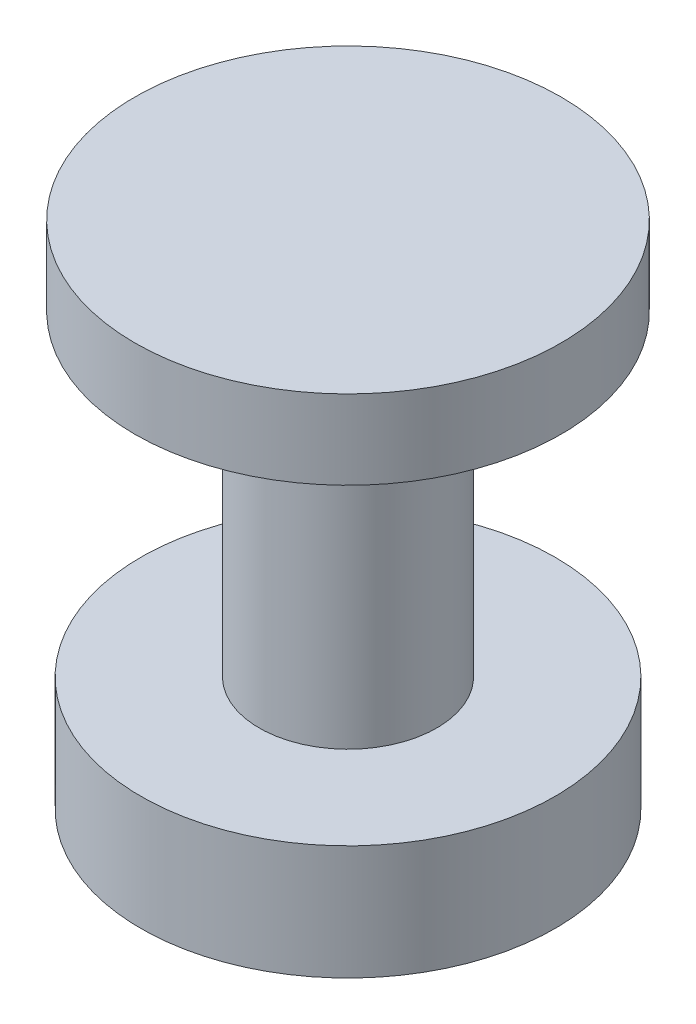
ISO-10303-21;
HEADER;
FILE_DESCRIPTION(('STEP AP214'),'2;1');
FILE_NAME('part.step','',(''),(''),'','','');
FILE_SCHEMA(('AUTOMOTIVE_DESIGN { 1 0 10303 214 1 1 1 1 }'));
ENDSEC;
DATA;
#1=APPLICATION_CONTEXT('core data for automotive mechanical design processes');
#2=APPLICATION_PROTOCOL_DEFINITION('international standard','automotive_design',2000,#1);
#3=PRODUCT_CONTEXT('',#1,'mechanical');
#4=PRODUCT('Part','Part','',(#3));
#5=PRODUCT_RELATED_PRODUCT_CATEGORY('part','',(#4));
#6=PRODUCT_DEFINITION_FORMATION('','',#4);
#7=PRODUCT_DEFINITION_CONTEXT('part definition',#1,'design');
#8=PRODUCT_DEFINITION('design','',#6,#7);
#9=PRODUCT_DEFINITION_SHAPE('','',#8);
#10=(LENGTH_UNIT() NAMED_UNIT(*) SI_UNIT(.MILLI.,.METRE.));
#11=(NAMED_UNIT(*) PLANE_ANGLE_UNIT() SI_UNIT($,.RADIAN.));
#12=(NAMED_UNIT(*) SI_UNIT($,.STERADIAN.) SOLID_ANGLE_UNIT());
#13=UNCERTAINTY_MEASURE_WITH_UNIT(LENGTH_MEASURE(1.E-05),#10,'distance_accuracy_value','');
#14=(GEOMETRIC_REPRESENTATION_CONTEXT(3) GLOBAL_UNCERTAINTY_ASSIGNED_CONTEXT((#13)) GLOBAL_UNIT_ASSIGNED_CONTEXT((#10,
#11,#12)) REPRESENTATION_CONTEXT('',''));
#15=CARTESIAN_POINT('',(0.,0.,0.));
#16=DIRECTION('',(0.,0.,1.));
#17=DIRECTION('',(1.,0.,0.));
#18=AXIS2_PLACEMENT_3D('',#15,#16,#17);
#19=CARTESIAN_POINT('',(0.,32.265731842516,0.));
#20=DIRECTION('',(0.,1.,0.));
#21=DIRECTION('',(0.,0.,1.));
#22=AXIS2_PLACEMENT_3D('',#19,#20,#21);
#23=PLANE('',#22);
#24=CARTESIAN_POINT('',(0.,32.265731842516,0.));
#25=DIRECTION('',(0.,-1.,0.));
#26=DIRECTION('',(0.,0.,-1.));
#27=AXIS2_PLACEMENT_3D('',#24,#25,#26);
#28=CIRCLE('',#27,13.4791443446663);
#29=CARTESIAN_POINT('',(0.,32.265731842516,-13.4791443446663));
#30=VERTEX_POINT('',#29);
#31=EDGE_CURVE('E10',#30,#30,#28,.T.);
#32=ORIENTED_EDGE('',*,*,#31,.F.);
#33=EDGE_LOOP('',(#32));
#34=FACE_BOUND('',#33,.T.);
#35=ADVANCED_FACE('F30',(#34),#23,.T.);
#36=CARTESIAN_POINT('',(0.,0.,0.));
#37=DIRECTION('',(0.,-1.,0.));
#38=DIRECTION('',(0.,0.,-1.));
#39=AXIS2_PLACEMENT_3D('',#36,#37,#38);
#40=CYLINDRICAL_SURFACE('',#39,13.4791443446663);
#41=ORIENTED_EDGE('',*,*,#31,.T.);
#42=EDGE_LOOP('',(#41));
#43=FACE_BOUND('',#42,.T.);
#44=CARTESIAN_POINT('',(0.,27.2609008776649,0.));
#45=DIRECTION('',(0.,-1.,0.));
#46=DIRECTION('',(0.,0.,-1.));
#47=AXIS2_PLACEMENT_3D('',#44,#45,#46);
#48=CIRCLE('',#47,13.4791443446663);
#49=CARTESIAN_POINT('',(0.,27.2609008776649,-13.4791443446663));
#50=VERTEX_POINT('',#49);
#51=EDGE_CURVE('E36',#50,#50,#48,.T.);
#52=ORIENTED_EDGE('',*,*,#51,.F.);
#53=EDGE_LOOP('',(#52));
#54=FACE_BOUND('',#53,.T.);
#55=ADVANCED_FACE('F72',(#43,#54),#40,.T.);
#56=CARTESIAN_POINT('',(13.4791443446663,27.2609008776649,0.));
#57=DIRECTION('',(0.,-1.,0.));
#58=DIRECTION('',(0.,0.,-1.));
#59=AXIS2_PLACEMENT_3D('',#56,#57,#58);
#60=PLANE('',#59);
#61=ORIENTED_EDGE('',*,*,#51,.T.);
#62=EDGE_LOOP('',(#61));
#63=FACE_BOUND('',#62,.T.);
#64=CARTESIAN_POINT('',(0.,27.2609008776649,0.));
#65=DIRECTION('',(0.,-1.,0.));
#66=DIRECTION('',(0.,0.,-1.));
#67=AXIS2_PLACEMENT_3D('',#64,#65,#66);
#68=CIRCLE('',#67,5.61771872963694);
#69=CARTESIAN_POINT('',(0.,27.2609008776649,-5.61771872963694));
#70=VERTEX_POINT('',#69);
#71=EDGE_CURVE('E40',#70,#70,#68,.T.);
#72=ORIENTED_EDGE('',*,*,#71,.F.);
#73=EDGE_LOOP('',(#72));
#74=FACE_BOUND('',#73,.T.);
#75=ADVANCED_FACE('F77',(#63,#74),#60,.T.);
#76=CARTESIAN_POINT('',(0.,0.,0.));
#77=DIRECTION('',(0.,-1.,0.));
#78=DIRECTION('',(0.,0.,-1.));
#79=AXIS2_PLACEMENT_3D('',#76,#77,#78);
#80=CYLINDRICAL_SURFACE('',#79,5.61771872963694);
#81=ORIENTED_EDGE('',*,*,#71,.T.);
#82=EDGE_LOOP('',(#81));
#83=FACE_BOUND('',#82,.T.);
#84=CARTESIAN_POINT('',(0.,7.24157701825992,0.));
#85=DIRECTION('',(0.,-1.,0.));
#86=DIRECTION('',(0.,0.,-1.));
#87=AXIS2_PLACEMENT_3D('',#84,#85,#86);
#88=CIRCLE('',#87,5.61771872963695);
#89=CARTESIAN_POINT('',(0.,7.24157701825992,-5.61771872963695));
#90=VERTEX_POINT('',#89);
#91=EDGE_CURVE('E44',#90,#90,#88,.T.);
#92=ORIENTED_EDGE('',*,*,#91,.F.);
#93=EDGE_LOOP('',(#92));
#94=FACE_BOUND('',#93,.T.);
#95=ADVANCED_FACE('F68',(#83,#94),#80,.T.);
#96=CARTESIAN_POINT('',(5.61771872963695,7.24157701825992,0.));
#97=DIRECTION('',(0.,1.,0.));
#98=DIRECTION('',(0.,0.,1.));
#99=AXIS2_PLACEMENT_3D('',#96,#97,#98);
#100=PLANE('',#99);
#101=ORIENTED_EDGE('',*,*,#91,.T.);
#102=EDGE_LOOP('',(#101));
#103=FACE_BOUND('',#102,.T.);
#104=CARTESIAN_POINT('',(0.,7.24157701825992,0.));
#105=DIRECTION('',(0.,-1.,0.));
#106=DIRECTION('',(0.,0.,-1.));
#107=AXIS2_PLACEMENT_3D('',#104,#105,#106);
#108=CIRCLE('',#107,13.1012244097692);
#109=CARTESIAN_POINT('',(0.,7.24157701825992,-13.1012244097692));
#110=VERTEX_POINT('',#109);
#111=EDGE_CURVE('E49',#110,#110,#108,.T.);
#112=ORIENTED_EDGE('',*,*,#111,.F.);
#113=EDGE_LOOP('',(#112));
#114=FACE_BOUND('',#113,.T.);
#115=ADVANCED_FACE('F60',(#103,#114),#100,.T.);
#116=CARTESIAN_POINT('',(0.,0.,0.));
#117=DIRECTION('',(0.,-1.,0.));
#118=DIRECTION('',(0.,0.,-1.));
#119=AXIS2_PLACEMENT_3D('',#116,#117,#118);
#120=CYLINDRICAL_SURFACE('',#119,13.1012244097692);
#121=ORIENTED_EDGE('',*,*,#111,.T.);
#122=EDGE_LOOP('',(#121));
#123=FACE_BOUND('',#122,.T.);
#124=CARTESIAN_POINT('',(0.,0.,0.));
#125=DIRECTION('',(0.,-1.,0.));
#126=DIRECTION('',(0.,0.,-1.));
#127=AXIS2_PLACEMENT_3D('',#124,#125,#126);
#128=CIRCLE('',#127,13.1012244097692);
#129=CARTESIAN_POINT('',(0.,0.,-13.1012244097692));
#130=VERTEX_POINT('',#129);
#131=EDGE_CURVE('E52',#130,#130,#128,.T.);
#132=ORIENTED_EDGE('',*,*,#131,.F.);
#133=EDGE_LOOP('',(#132));
#134=FACE_BOUND('',#133,.T.);
#135=ADVANCED_FACE('F58',(#123,#134),#120,.T.);
#136=CARTESIAN_POINT('',(13.1012244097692,0.,0.));
#137=DIRECTION('',(0.,-1.,0.));
#138=DIRECTION('',(0.,0.,-1.));
#139=AXIS2_PLACEMENT_3D('',#136,#137,#138);
#140=PLANE('',#139);
#141=ORIENTED_EDGE('',*,*,#131,.T.);
#142=EDGE_LOOP('',(#141));
#143=FACE_BOUND('',#142,.T.);
#144=ADVANCED_FACE('F56',(#143),#140,.T.);
#145=CLOSED_SHELL('',(#35,#55,#75,#95,#115,#135,#144));
#146=MANIFOLD_SOLID_BREP('B2',#145);
#147=ADVANCED_BREP_SHAPE_REPRESENTATION('',(#18,#146),#14);
#148=SHAPE_DEFINITION_REPRESENTATION(#9,#147);
ENDSEC;
END-ISO-10303-21;
